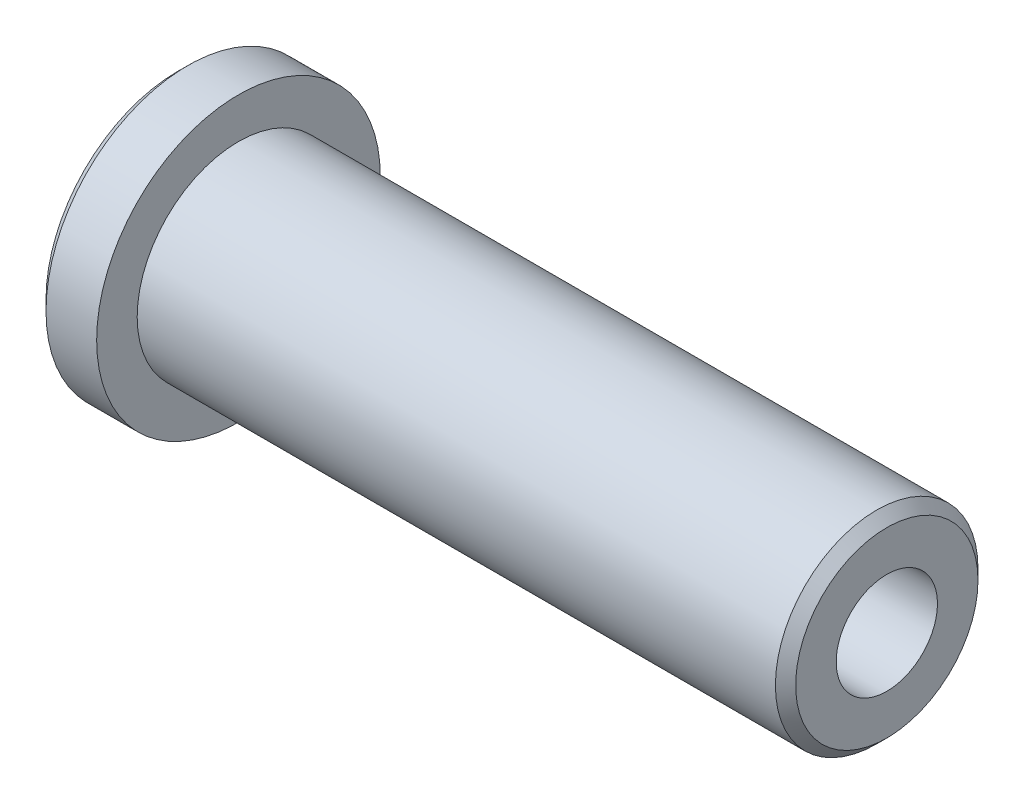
ISO-10303-21;
HEADER;
FILE_DESCRIPTION(('STEP AP214'),'2;1');
FILE_NAME('part.step','',(''),(''),'','','');
FILE_SCHEMA(('AUTOMOTIVE_DESIGN { 1 0 10303 214 1 1 1 1 }'));
ENDSEC;
DATA;
#1=APPLICATION_CONTEXT('core data for automotive mechanical design processes');
#2=APPLICATION_PROTOCOL_DEFINITION('international standard','automotive_design',2000,#1);
#3=PRODUCT_CONTEXT('',#1,'mechanical');
#4=PRODUCT('Part','Part','',(#3));
#5=PRODUCT_RELATED_PRODUCT_CATEGORY('part','',(#4));
#6=PRODUCT_DEFINITION_FORMATION('','',#4);
#7=PRODUCT_DEFINITION_CONTEXT('part definition',#1,'design');
#8=PRODUCT_DEFINITION('design','',#6,#7);
#9=PRODUCT_DEFINITION_SHAPE('','',#8);
#10=(LENGTH_UNIT() NAMED_UNIT(*) SI_UNIT(.MILLI.,.METRE.));
#11=(NAMED_UNIT(*) PLANE_ANGLE_UNIT() SI_UNIT($,.RADIAN.));
#12=(NAMED_UNIT(*) SI_UNIT($,.STERADIAN.) SOLID_ANGLE_UNIT());
#13=UNCERTAINTY_MEASURE_WITH_UNIT(LENGTH_MEASURE(1.E-05),#10,'distance_accuracy_value','');
#14=(GEOMETRIC_REPRESENTATION_CONTEXT(3) GLOBAL_UNCERTAINTY_ASSIGNED_CONTEXT((#13)) GLOBAL_UNIT_ASSIGNED_CONTEXT((#10,
#11,#12)) REPRESENTATION_CONTEXT('',''));
#15=CARTESIAN_POINT('',(0.,0.,0.));
#16=DIRECTION('',(0.,0.,1.));
#17=DIRECTION('',(1.,0.,0.));
#18=AXIS2_PLACEMENT_3D('',#15,#16,#17);
#19=CARTESIAN_POINT('',(32.,0.,0.));
#20=DIRECTION('',(-1.,0.,0.));
#21=DIRECTION('',(0.,0.,1.));
#22=AXIS2_PLACEMENT_3D('',#19,#20,#21);
#23=CYLINDRICAL_SURFACE('',#22,5.);
#24=CARTESIAN_POINT('',(31.5,0.,0.));
#25=DIRECTION('',(1.,0.,0.));
#26=DIRECTION('',(0.,0.,-1.));
#27=AXIS2_PLACEMENT_3D('',#24,#25,#26);
#28=CIRCLE('',#27,5.);
#29=CARTESIAN_POINT('',(31.5,0.,-5.00000000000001));
#30=VERTEX_POINT('',#29);
#31=EDGE_CURVE('E11',#30,#30,#28,.F.);
#32=ORIENTED_EDGE('',*,*,#31,.T.);
#33=EDGE_LOOP('',(#32));
#34=FACE_BOUND('',#33,.T.);
#35=CARTESIAN_POINT('',(0.,0.,0.));
#36=DIRECTION('',(1.,0.,0.));
#37=DIRECTION('',(0.,0.,-1.));
#38=AXIS2_PLACEMENT_3D('',#35,#36,#37);
#39=CIRCLE('',#38,5.);
#40=CARTESIAN_POINT('',(0.,0.,-5.00000000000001));
#41=VERTEX_POINT('',#40);
#42=EDGE_CURVE('E135',#41,#41,#39,.T.);
#43=ORIENTED_EDGE('',*,*,#42,.T.);
#44=EDGE_LOOP('',(#43));
#45=FACE_BOUND('',#44,.T.);
#46=ADVANCED_FACE('F24',(#34,#45),#23,.T.);
#47=CARTESIAN_POINT('',(32.,0.,0.));
#48=DIRECTION('',(1.,0.,0.));
#49=DIRECTION('',(0.,0.,-1.));
#50=AXIS2_PLACEMENT_3D('',#47,#48,#49);
#51=PLANE('',#50);
#52=CARTESIAN_POINT('',(32.,0.,0.));
#53=DIRECTION('',(1.,0.,0.));
#54=DIRECTION('',(0.,0.,-1.));
#55=AXIS2_PLACEMENT_3D('',#52,#53,#54);
#56=CIRCLE('',#55,2.5);
#57=CARTESIAN_POINT('',(32.,0.,-2.5));
#58=VERTEX_POINT('',#57);
#59=EDGE_CURVE('E261',#58,#58,#56,.T.);
#60=ORIENTED_EDGE('',*,*,#59,.F.);
#61=EDGE_LOOP('',(#60));
#62=FACE_BOUND('',#61,.T.);
#63=CARTESIAN_POINT('',(32.,0.,0.));
#64=DIRECTION('',(1.,0.,0.));
#65=DIRECTION('',(0.,0.,-1.));
#66=AXIS2_PLACEMENT_3D('',#63,#64,#65);
#67=CIRCLE('',#66,4.5);
#68=CARTESIAN_POINT('',(32.,0.,-4.50000000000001));
#69=VERTEX_POINT('',#68);
#70=EDGE_CURVE('E31',#69,#69,#67,.T.);
#71=ORIENTED_EDGE('',*,*,#70,.T.);
#72=EDGE_LOOP('',(#71));
#73=FACE_BOUND('',#72,.T.);
#74=ADVANCED_FACE('F146',(#62,#73),#51,.T.);
#75=CARTESIAN_POINT('',(0.,0.,0.));
#76=DIRECTION('',(1.,0.,0.));
#77=DIRECTION('',(0.,0.,-1.));
#78=AXIS2_PLACEMENT_3D('',#75,#76,#77);
#79=PLANE('',#78);
#80=CARTESIAN_POINT('',(0.,0.,0.));
#81=DIRECTION('',(1.,0.,0.));
#82=DIRECTION('',(0.,0.,-1.));
#83=AXIS2_PLACEMENT_3D('',#80,#81,#82);
#84=CIRCLE('',#83,7.);
#85=CARTESIAN_POINT('',(0.,0.,-7.00000000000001));
#86=VERTEX_POINT('',#85);
#87=EDGE_CURVE('E126',#86,#86,#84,.T.);
#88=ORIENTED_EDGE('',*,*,#87,.T.);
#89=EDGE_LOOP('',(#88));
#90=FACE_BOUND('',#89,.T.);
#91=ORIENTED_EDGE('',*,*,#42,.F.);
#92=EDGE_LOOP('',(#91));
#93=FACE_BOUND('',#92,.T.);
#94=ADVANCED_FACE('F168',(#90,#93),#79,.T.);
#95=CARTESIAN_POINT('',(-3.,0.,0.));
#96=DIRECTION('',(1.,0.,0.));
#97=DIRECTION('',(0.,0.,-1.));
#98=AXIS2_PLACEMENT_3D('',#95,#96,#97);
#99=CYLINDRICAL_SURFACE('',#98,7.);
#100=CARTESIAN_POINT('',(-2.5,0.,0.));
#101=DIRECTION('',(1.,0.,0.));
#102=DIRECTION('',(0.,0.,-1.));
#103=AXIS2_PLACEMENT_3D('',#100,#101,#102);
#104=CIRCLE('',#103,7.);
#105=CARTESIAN_POINT('',(-2.5,0.,-7.00000000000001));
#106=VERTEX_POINT('',#105);
#107=EDGE_CURVE('E138',#106,#106,#104,.T.);
#108=ORIENTED_EDGE('',*,*,#107,.T.);
#109=EDGE_LOOP('',(#108));
#110=FACE_BOUND('',#109,.T.);
#111=ORIENTED_EDGE('',*,*,#87,.F.);
#112=EDGE_LOOP('',(#111));
#113=FACE_BOUND('',#112,.T.);
#114=ADVANCED_FACE('F174',(#110,#113),#99,.T.);
#115=CARTESIAN_POINT('',(-3.,0.,0.));
#116=DIRECTION('',(1.,0.,0.));
#117=DIRECTION('',(0.,0.,-1.));
#118=AXIS2_PLACEMENT_3D('',#115,#116,#117);
#119=PLANE('',#118);
#120=DIRECTION('',(0.,0.866025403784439,0.500000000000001));
#121=VECTOR('',#120,1.);
#122=CARTESIAN_POINT('',(-3.,-2.5,1.44337567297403));
#123=LINE('',#122,#121);
#124=CARTESIAN_POINT('',(-3.,-2.5,1.44337567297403));
#125=VERTEX_POINT('',#124);
#126=CARTESIAN_POINT('',(-3.,0.,2.88675134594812));
#127=VERTEX_POINT('',#126);
#128=EDGE_CURVE('E92',#125,#127,#123,.T.);
#129=ORIENTED_EDGE('',*,*,#128,.F.);
#130=DIRECTION('',(0.,0.,1.));
#131=VECTOR('',#130,1.);
#132=CARTESIAN_POINT('',(-3.00000000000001,-2.50000000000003,-1.44337567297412));
#133=LINE('',#132,#131);
#134=CARTESIAN_POINT('',(-3.00000000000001,-2.50000000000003,-1.44337567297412));
#135=VERTEX_POINT('',#134);
#136=EDGE_CURVE('E38',#135,#125,#133,.T.);
#137=ORIENTED_EDGE('',*,*,#136,.F.);
#138=DIRECTION('',(0.,-0.866025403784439,0.500000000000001));
#139=VECTOR('',#138,1.);
#140=CARTESIAN_POINT('',(-3.00000000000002,0.,-2.88675134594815));
#141=LINE('',#140,#139);
#142=CARTESIAN_POINT('',(-3.00000000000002,0.,-2.88675134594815));
#143=VERTEX_POINT('',#142);
#144=EDGE_CURVE('E108',#143,#135,#141,.T.);
#145=ORIENTED_EDGE('',*,*,#144,.F.);
#146=DIRECTION('',(0.,-0.866025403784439,-0.500000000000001));
#147=VECTOR('',#146,1.);
#148=CARTESIAN_POINT('',(-3.,2.49999999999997,-1.44337567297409));
#149=LINE('',#148,#147);
#150=CARTESIAN_POINT('',(-3.,2.49999999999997,-1.44337567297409));
#151=VERTEX_POINT('',#150);
#152=EDGE_CURVE('E102',#151,#143,#149,.T.);
#153=ORIENTED_EDGE('',*,*,#152,.F.);
#154=DIRECTION('',(0.,0.,-1.));
#155=VECTOR('',#154,1.);
#156=CARTESIAN_POINT('',(-3.,2.49999999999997,1.44337567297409));
#157=LINE('',#156,#155);
#158=CARTESIAN_POINT('',(-3.,2.49999999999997,1.44337567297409));
#159=VERTEX_POINT('',#158);
#160=EDGE_CURVE('E100',#159,#151,#157,.T.);
#161=ORIENTED_EDGE('',*,*,#160,.F.);
#162=DIRECTION('',(0.,0.866025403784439,-0.500000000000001));
#163=VECTOR('',#162,1.);
#164=CARTESIAN_POINT('',(-3.,0.,2.88675134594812));
#165=LINE('',#164,#163);
#166=EDGE_CURVE('E81',#127,#159,#165,.T.);
#167=ORIENTED_EDGE('',*,*,#166,.F.);
#168=EDGE_LOOP('',(#129,#137,#145,#153,#161,#167));
#169=FACE_BOUND('',#168,.T.);
#170=CARTESIAN_POINT('',(-3.,0.,0.));
#171=DIRECTION('',(1.,0.,0.));
#172=DIRECTION('',(0.,0.,-1.));
#173=AXIS2_PLACEMENT_3D('',#170,#171,#172);
#174=CIRCLE('',#173,6.5);
#175=CARTESIAN_POINT('',(-3.,0.,-6.50000000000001));
#176=VERTEX_POINT('',#175);
#177=EDGE_CURVE('E141',#176,#176,#174,.F.);
#178=ORIENTED_EDGE('',*,*,#177,.T.);
#179=EDGE_LOOP('',(#178));
#180=FACE_BOUND('',#179,.T.);
#181=ADVANCED_FACE('F96',(#169,#180),#119,.F.);
#182=CARTESIAN_POINT('',(-2.5,0.,0.));
#183=DIRECTION('',(1.,0.,0.));
#184=DIRECTION('',(0.,0.,-1.));
#185=AXIS2_PLACEMENT_3D('',#182,#183,#184);
#186=CONICAL_SURFACE('',#185,7.,0.785398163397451);
#187=ORIENTED_EDGE('',*,*,#177,.F.);
#188=EDGE_LOOP('',(#187));
#189=FACE_BOUND('',#188,.T.);
#190=ORIENTED_EDGE('',*,*,#107,.F.);
#191=EDGE_LOOP('',(#190));
#192=FACE_BOUND('',#191,.T.);
#193=ADVANCED_FACE('F151',(#189,#192),#186,.T.);
#194=CARTESIAN_POINT('',(32.,0.,0.));
#195=DIRECTION('',(-1.,0.,0.));
#196=DIRECTION('',(0.,0.,1.));
#197=AXIS2_PLACEMENT_3D('',#194,#195,#196);
#198=CONICAL_SURFACE('',#197,4.5,0.785398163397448);
#199=ORIENTED_EDGE('',*,*,#31,.F.);
#200=EDGE_LOOP('',(#199));
#201=FACE_BOUND('',#200,.T.);
#202=ORIENTED_EDGE('',*,*,#70,.F.);
#203=EDGE_LOOP('',(#202));
#204=FACE_BOUND('',#203,.T.);
#205=ADVANCED_FACE('F148',(#201,#204),#198,.T.);
#206=CARTESIAN_POINT('',(3.,-2.50000000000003,-1.44337567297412));
#207=DIRECTION('',(0.,-1.,0.));
#208=DIRECTION('',(0.,0.,-1.));
#209=AXIS2_PLACEMENT_3D('',#206,#207,#208);
#210=PLANE('',#209);
#211=ORIENTED_EDGE('',*,*,#136,.T.);
#212=DIRECTION('',(-1.,0.,0.));
#213=VECTOR('',#212,1.);
#214=CARTESIAN_POINT('',(3.,-2.49999999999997,1.44337567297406));
#215=LINE('',#214,#213);
#216=CARTESIAN_POINT('',(3.,-2.49999999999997,1.44337567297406));
#217=VERTEX_POINT('',#216);
#218=EDGE_CURVE('E89',#217,#125,#215,.T.);
#219=ORIENTED_EDGE('',*,*,#218,.F.);
#220=DIRECTION('',(0.,0.,1.));
#221=VECTOR('',#220,1.);
#222=CARTESIAN_POINT('',(3.,-2.50000000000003,-1.44337567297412));
#223=LINE('',#222,#221);
#224=CARTESIAN_POINT('',(3.,-2.50000000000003,-1.44337567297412));
#225=VERTEX_POINT('',#224);
#226=EDGE_CURVE('E110',#225,#217,#223,.T.);
#227=ORIENTED_EDGE('',*,*,#226,.F.);
#228=DIRECTION('',(-1.,0.,0.));
#229=VECTOR('',#228,1.);
#230=CARTESIAN_POINT('',(3.,-2.50000000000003,-1.44337567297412));
#231=LINE('',#230,#229);
#232=EDGE_CURVE('E45',#225,#135,#231,.T.);
#233=ORIENTED_EDGE('',*,*,#232,.T.);
#234=EDGE_LOOP('',(#211,#219,#227,#233));
#235=FACE_BOUND('',#234,.T.);
#236=ADVANCED_FACE('F150',(#235),#210,.F.);
#237=CARTESIAN_POINT('',(3.,0.,-2.88675134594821));
#238=DIRECTION('',(0.,-0.5,-0.86602540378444));
#239=DIRECTION('',(0.,0.866025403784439,-0.500000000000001));
#240=AXIS2_PLACEMENT_3D('',#237,#238,#239);
#241=PLANE('',#240);
#242=ORIENTED_EDGE('',*,*,#144,.T.);
#243=ORIENTED_EDGE('',*,*,#232,.F.);
#244=DIRECTION('',(0.,-0.866025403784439,0.500000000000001));
#245=VECTOR('',#244,1.);
#246=CARTESIAN_POINT('',(3.,0.,-2.88675134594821));
#247=LINE('',#246,#245);
#248=CARTESIAN_POINT('',(3.,0.,-2.88675134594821));
#249=VERTEX_POINT('',#248);
#250=EDGE_CURVE('E122',#249,#225,#247,.T.);
#251=ORIENTED_EDGE('',*,*,#250,.F.);
#252=DIRECTION('',(-1.,0.,0.));
#253=VECTOR('',#252,1.);
#254=CARTESIAN_POINT('',(3.,0.,-2.88675134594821));
#255=LINE('',#254,#253);
#256=EDGE_CURVE('E127',#249,#143,#255,.T.);
#257=ORIENTED_EDGE('',*,*,#256,.T.);
#258=EDGE_LOOP('',(#242,#243,#251,#257));
#259=FACE_BOUND('',#258,.T.);
#260=ADVANCED_FACE('F158',(#259),#241,.F.);
#261=CARTESIAN_POINT('',(3.,2.49999999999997,-1.44337567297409));
#262=DIRECTION('',(0.,0.5,-0.86602540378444));
#263=DIRECTION('',(0.,0.866025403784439,0.500000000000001));
#264=AXIS2_PLACEMENT_3D('',#261,#262,#263);
#265=PLANE('',#264);
#266=ORIENTED_EDGE('',*,*,#152,.T.);
#267=ORIENTED_EDGE('',*,*,#256,.F.);
#268=DIRECTION('',(0.,-0.866025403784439,-0.500000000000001));
#269=VECTOR('',#268,1.);
#270=CARTESIAN_POINT('',(3.,2.49999999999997,-1.44337567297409));
#271=LINE('',#270,#269);
#272=CARTESIAN_POINT('',(3.,2.49999999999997,-1.44337567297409));
#273=VERTEX_POINT('',#272);
#274=EDGE_CURVE('E119',#273,#249,#271,.T.);
#275=ORIENTED_EDGE('',*,*,#274,.F.);
#276=DIRECTION('',(-1.,0.,0.));
#277=VECTOR('',#276,1.);
#278=CARTESIAN_POINT('',(3.,2.49999999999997,-1.44337567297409));
#279=LINE('',#278,#277);
#280=EDGE_CURVE('E129',#273,#151,#279,.T.);
#281=ORIENTED_EDGE('',*,*,#280,.T.);
#282=EDGE_LOOP('',(#266,#267,#275,#281));
#283=FACE_BOUND('',#282,.T.);
#284=ADVANCED_FACE('F205',(#283),#265,.F.);
#285=CARTESIAN_POINT('',(3.,2.49999999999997,1.44337567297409));
#286=DIRECTION('',(0.,1.,0.));
#287=DIRECTION('',(0.,0.,1.));
#288=AXIS2_PLACEMENT_3D('',#285,#286,#287);
#289=PLANE('',#288);
#290=ORIENTED_EDGE('',*,*,#160,.T.);
#291=ORIENTED_EDGE('',*,*,#280,.F.);
#292=DIRECTION('',(0.,0.,-1.));
#293=VECTOR('',#292,1.);
#294=CARTESIAN_POINT('',(3.,2.49999999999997,1.44337567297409));
#295=LINE('',#294,#293);
#296=CARTESIAN_POINT('',(3.,2.49999999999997,1.44337567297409));
#297=VERTEX_POINT('',#296);
#298=EDGE_CURVE('E116',#297,#273,#295,.T.);
#299=ORIENTED_EDGE('',*,*,#298,.F.);
#300=DIRECTION('',(-1.,0.,0.));
#301=VECTOR('',#300,1.);
#302=CARTESIAN_POINT('',(3.,2.49999999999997,1.44337567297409));
#303=LINE('',#302,#301);
#304=EDGE_CURVE('E88',#297,#159,#303,.T.);
#305=ORIENTED_EDGE('',*,*,#304,.T.);
#306=EDGE_LOOP('',(#290,#291,#299,#305));
#307=FACE_BOUND('',#306,.T.);
#308=ADVANCED_FACE('F212',(#307),#289,.F.);
#309=CARTESIAN_POINT('',(3.,0.,2.88675134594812));
#310=DIRECTION('',(0.,0.5,0.86602540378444));
#311=DIRECTION('',(0.,-0.866025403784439,0.500000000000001));
#312=AXIS2_PLACEMENT_3D('',#309,#310,#311);
#313=PLANE('',#312);
#314=ORIENTED_EDGE('',*,*,#166,.T.);
#315=ORIENTED_EDGE('',*,*,#304,.F.);
#316=DIRECTION('',(0.,0.866025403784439,-0.500000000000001));
#317=VECTOR('',#316,1.);
#318=CARTESIAN_POINT('',(3.,0.,2.88675134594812));
#319=LINE('',#318,#317);
#320=CARTESIAN_POINT('',(3.,0.,2.88675134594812));
#321=VERTEX_POINT('',#320);
#322=EDGE_CURVE('E84',#321,#297,#319,.T.);
#323=ORIENTED_EDGE('',*,*,#322,.F.);
#324=DIRECTION('',(-1.,0.,0.));
#325=VECTOR('',#324,1.);
#326=CARTESIAN_POINT('',(3.,0.,2.88675134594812));
#327=LINE('',#326,#325);
#328=EDGE_CURVE('E77',#321,#127,#327,.T.);
#329=ORIENTED_EDGE('',*,*,#328,.T.);
#330=EDGE_LOOP('',(#314,#315,#323,#329));
#331=FACE_BOUND('',#330,.T.);
#332=ADVANCED_FACE('F79',(#331),#313,.F.);
#333=CARTESIAN_POINT('',(3.,-2.49999999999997,1.44337567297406));
#334=DIRECTION('',(0.,-0.5,0.86602540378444));
#335=DIRECTION('',(0.,-0.866025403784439,-0.500000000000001));
#336=AXIS2_PLACEMENT_3D('',#333,#334,#335);
#337=PLANE('',#336);
#338=ORIENTED_EDGE('',*,*,#128,.T.);
#339=ORIENTED_EDGE('',*,*,#328,.F.);
#340=DIRECTION('',(0.,0.866025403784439,0.500000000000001));
#341=VECTOR('',#340,1.);
#342=CARTESIAN_POINT('',(3.,-2.49999999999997,1.44337567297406));
#343=LINE('',#342,#341);
#344=EDGE_CURVE('E113',#217,#321,#343,.T.);
#345=ORIENTED_EDGE('',*,*,#344,.F.);
#346=ORIENTED_EDGE('',*,*,#218,.T.);
#347=EDGE_LOOP('',(#338,#339,#345,#346));
#348=FACE_BOUND('',#347,.T.);
#349=ADVANCED_FACE('F93',(#348),#337,.F.);
#350=CARTESIAN_POINT('',(3.,-2.49999999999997,4.3301270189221));
#351=DIRECTION('',(-1.,0.,0.));
#352=DIRECTION('',(0.,0.,1.));
#353=AXIS2_PLACEMENT_3D('',#350,#351,#352);
#354=PLANE('',#353);
#355=ORIENTED_EDGE('',*,*,#226,.T.);
#356=ORIENTED_EDGE('',*,*,#344,.T.);
#357=ORIENTED_EDGE('',*,*,#322,.T.);
#358=ORIENTED_EDGE('',*,*,#298,.T.);
#359=ORIENTED_EDGE('',*,*,#274,.T.);
#360=ORIENTED_EDGE('',*,*,#250,.T.);
#361=EDGE_LOOP('',(#355,#356,#357,#358,#359,#360));
#362=FACE_BOUND('',#361,.T.);
#363=ADVANCED_FACE('F233',(#362),#354,.T.);
#364=CARTESIAN_POINT('',(10.,0.,0.));
#365=DIRECTION('',(1.,0.,0.));
#366=DIRECTION('',(0.,0.,-1.));
#367=AXIS2_PLACEMENT_3D('',#364,#365,#366);
#368=CYLINDRICAL_SURFACE('',#367,2.5);
#369=CARTESIAN_POINT('',(10.,0.,0.));
#370=DIRECTION('',(1.,0.,0.));
#371=DIRECTION('',(0.,0.,-1.));
#372=AXIS2_PLACEMENT_3D('',#369,#370,#371);
#373=CIRCLE('',#372,2.5);
#374=CARTESIAN_POINT('',(10.,0.,-2.5));
#375=VERTEX_POINT('',#374);
#376=EDGE_CURVE('E260',#375,#375,#373,.T.);
#377=ORIENTED_EDGE('',*,*,#376,.F.);
#378=EDGE_LOOP('',(#377));
#379=FACE_BOUND('',#378,.T.);
#380=ORIENTED_EDGE('',*,*,#59,.T.);
#381=EDGE_LOOP('',(#380));
#382=FACE_BOUND('',#381,.T.);
#383=ADVANCED_FACE('F240',(#379,#382),#368,.F.);
#384=CARTESIAN_POINT('',(10.,0.,0.));
#385=DIRECTION('',(1.,0.,0.));
#386=DIRECTION('',(0.,0.,-1.));
#387=AXIS2_PLACEMENT_3D('',#384,#385,#386);
#388=PLANE('',#387);
#389=ORIENTED_EDGE('',*,*,#376,.T.);
#390=EDGE_LOOP('',(#389));
#391=FACE_BOUND('',#390,.T.);
#392=ADVANCED_FACE('F248',(#391),#388,.T.);
#393=CLOSED_SHELL('',(#46,#74,#94,#114,#181,#193,#205,#236,#260,#284,#308,#332,#349,#363,#383,#392));
#394=MANIFOLD_SOLID_BREP('B2',#393);
#395=ADVANCED_BREP_SHAPE_REPRESENTATION('',(#18,#394),#14);
#396=SHAPE_DEFINITION_REPRESENTATION(#9,#395);
ENDSEC;
END-ISO-10303-21;
